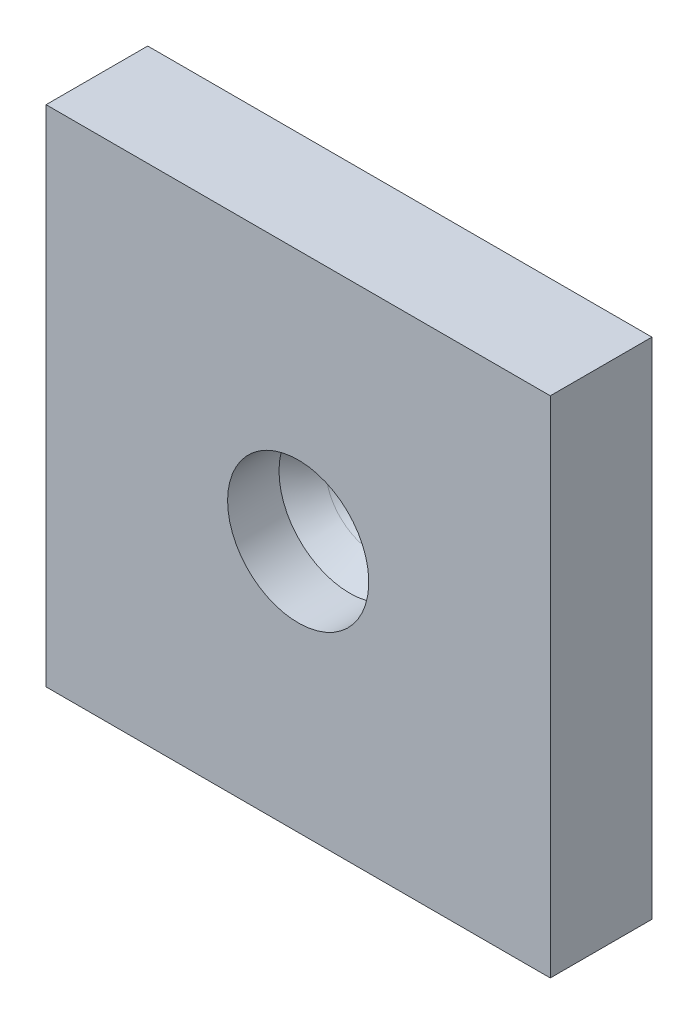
ISO-10303-21;
HEADER;
FILE_DESCRIPTION(('STEP AP214'),'2;1');
FILE_NAME('part.step','',(''),(''),'','','');
FILE_SCHEMA(('AUTOMOTIVE_DESIGN { 1 0 10303 214 1 1 1 1 }'));
ENDSEC;
DATA;
#1=APPLICATION_CONTEXT('core data for automotive mechanical design processes');
#2=APPLICATION_PROTOCOL_DEFINITION('international standard','automotive_design',2000,#1);
#3=PRODUCT_CONTEXT('',#1,'mechanical');
#4=PRODUCT('Part','Part','',(#3));
#5=PRODUCT_RELATED_PRODUCT_CATEGORY('part','',(#4));
#6=PRODUCT_DEFINITION_FORMATION('','',#4);
#7=PRODUCT_DEFINITION_CONTEXT('part definition',#1,'design');
#8=PRODUCT_DEFINITION('design','',#6,#7);
#9=PRODUCT_DEFINITION_SHAPE('','',#8);
#10=(LENGTH_UNIT() NAMED_UNIT(*) SI_UNIT(.MILLI.,.METRE.));
#11=(NAMED_UNIT(*) PLANE_ANGLE_UNIT() SI_UNIT($,.RADIAN.));
#12=(NAMED_UNIT(*) SI_UNIT($,.STERADIAN.) SOLID_ANGLE_UNIT());
#13=UNCERTAINTY_MEASURE_WITH_UNIT(LENGTH_MEASURE(1.E-05),#10,'distance_accuracy_value','');
#14=(GEOMETRIC_REPRESENTATION_CONTEXT(3) GLOBAL_UNCERTAINTY_ASSIGNED_CONTEXT((#13)) GLOBAL_UNIT_ASSIGNED_CONTEXT((#10,
#11,#12)) REPRESENTATION_CONTEXT('',''));
#15=CARTESIAN_POINT('',(0.,0.,0.));
#16=DIRECTION('',(0.,0.,1.));
#17=DIRECTION('',(1.,0.,0.));
#18=AXIS2_PLACEMENT_3D('',#15,#16,#17);
#19=CARTESIAN_POINT('',(0.,0.,0.));
#20=DIRECTION('',(0.,0.,1.));
#21=DIRECTION('',(0.,-1.,0.));
#22=AXIS2_PLACEMENT_3D('',#19,#20,#21);
#23=PLANE('',#22);
#24=DIRECTION('',(0.,1.,0.));
#25=VECTOR('',#24,1.);
#26=CARTESIAN_POINT('',(15.875,15.875,0.));
#27=LINE('',#26,#25);
#28=CARTESIAN_POINT('',(15.875,-15.875,0.));
#29=VERTEX_POINT('',#28);
#30=CARTESIAN_POINT('',(15.875,15.875,0.));
#31=VERTEX_POINT('',#30);
#32=EDGE_CURVE('E58',#29,#31,#27,.T.);
#33=ORIENTED_EDGE('',*,*,#32,.F.);
#34=DIRECTION('',(1.,0.,0.));
#35=VECTOR('',#34,1.);
#36=CARTESIAN_POINT('',(-15.875,-15.875,0.));
#37=LINE('',#36,#35);
#38=CARTESIAN_POINT('',(-15.875,-15.875,0.));
#39=VERTEX_POINT('',#38);
#40=EDGE_CURVE('E64',#39,#29,#37,.T.);
#41=ORIENTED_EDGE('',*,*,#40,.F.);
#42=DIRECTION('',(0.,-1.,0.));
#43=VECTOR('',#42,1.);
#44=CARTESIAN_POINT('',(-15.875,15.875,0.));
#45=LINE('',#44,#43);
#46=CARTESIAN_POINT('',(-15.875,15.875,0.));
#47=VERTEX_POINT('',#46);
#48=EDGE_CURVE('E95',#47,#39,#45,.T.);
#49=ORIENTED_EDGE('',*,*,#48,.F.);
#50=DIRECTION('',(-1.,0.,0.));
#51=VECTOR('',#50,1.);
#52=CARTESIAN_POINT('',(-15.875,15.875,0.));
#53=LINE('',#52,#51);
#54=EDGE_CURVE('E93',#31,#47,#53,.T.);
#55=ORIENTED_EDGE('',*,*,#54,.F.);
#56=EDGE_LOOP('',(#33,#41,#49,#55));
#57=FACE_BOUND('',#56,.T.);
#58=CARTESIAN_POINT('',(0.,0.,0.));
#59=DIRECTION('',(0.,0.,-1.));
#60=DIRECTION('',(0.,1.,0.));
#61=AXIS2_PLACEMENT_3D('',#58,#59,#60);
#62=CIRCLE('',#61,2.2479);
#63=CARTESIAN_POINT('',(0.,2.2479,0.));
#64=VERTEX_POINT('',#63);
#65=EDGE_CURVE('E85',#64,#64,#62,.T.);
#66=ORIENTED_EDGE('',*,*,#65,.F.);
#67=EDGE_LOOP('',(#66));
#68=FACE_BOUND('',#67,.T.);
#69=ADVANCED_FACE('F14',(#57,#68),#23,.F.);
#70=CARTESIAN_POINT('',(15.875,15.875,0.));
#71=DIRECTION('',(1.,0.,0.));
#72=DIRECTION('',(0.,1.,0.));
#73=AXIS2_PLACEMENT_3D('',#70,#71,#72);
#74=PLANE('',#73);
#75=DIRECTION('',(0.,0.,1.));
#76=VECTOR('',#75,1.);
#77=CARTESIAN_POINT('',(15.875,15.875,0.));
#78=LINE('',#77,#76);
#79=CARTESIAN_POINT('',(15.875,15.875,6.4));
#80=VERTEX_POINT('',#79);
#81=EDGE_CURVE('E54',#31,#80,#78,.T.);
#82=ORIENTED_EDGE('',*,*,#81,.T.);
#83=DIRECTION('',(0.,-1.,0.));
#84=VECTOR('',#83,1.);
#85=CARTESIAN_POINT('',(15.875,15.875,6.4));
#86=LINE('',#85,#84);
#87=CARTESIAN_POINT('',(15.875,-15.875,6.4));
#88=VERTEX_POINT('',#87);
#89=EDGE_CURVE('E57',#80,#88,#86,.T.);
#90=ORIENTED_EDGE('',*,*,#89,.T.);
#91=DIRECTION('',(0.,0.,1.));
#92=VECTOR('',#91,1.);
#93=CARTESIAN_POINT('',(15.875,-15.875,0.));
#94=LINE('',#93,#92);
#95=EDGE_CURVE('E9',#29,#88,#94,.T.);
#96=ORIENTED_EDGE('',*,*,#95,.F.);
#97=ORIENTED_EDGE('',*,*,#32,.T.);
#98=EDGE_LOOP('',(#82,#90,#96,#97));
#99=FACE_BOUND('',#98,.T.);
#100=ADVANCED_FACE('F56',(#99),#74,.T.);
#101=CARTESIAN_POINT('',(-15.875,-15.875,0.));
#102=DIRECTION('',(0.,-1.,0.));
#103=DIRECTION('',(1.,0.,0.));
#104=AXIS2_PLACEMENT_3D('',#101,#102,#103);
#105=PLANE('',#104);
#106=ORIENTED_EDGE('',*,*,#95,.T.);
#107=DIRECTION('',(-1.,0.,0.));
#108=VECTOR('',#107,1.);
#109=CARTESIAN_POINT('',(15.875,-15.875,6.4));
#110=LINE('',#109,#108);
#111=CARTESIAN_POINT('',(-15.875,-15.875,6.4));
#112=VERTEX_POINT('',#111);
#113=EDGE_CURVE('E73',#88,#112,#110,.T.);
#114=ORIENTED_EDGE('',*,*,#113,.T.);
#115=DIRECTION('',(0.,0.,1.));
#116=VECTOR('',#115,1.);
#117=CARTESIAN_POINT('',(-15.875,-15.875,0.));
#118=LINE('',#117,#116);
#119=EDGE_CURVE('E24',#39,#112,#118,.T.);
#120=ORIENTED_EDGE('',*,*,#119,.F.);
#121=ORIENTED_EDGE('',*,*,#40,.T.);
#122=EDGE_LOOP('',(#106,#114,#120,#121));
#123=FACE_BOUND('',#122,.T.);
#124=ADVANCED_FACE('F125',(#123),#105,.T.);
#125=CARTESIAN_POINT('',(-15.875,15.875,0.));
#126=DIRECTION('',(-1.,0.,0.));
#127=DIRECTION('',(0.,-1.,0.));
#128=AXIS2_PLACEMENT_3D('',#125,#126,#127);
#129=PLANE('',#128);
#130=ORIENTED_EDGE('',*,*,#119,.T.);
#131=DIRECTION('',(0.,1.,0.));
#132=VECTOR('',#131,1.);
#133=CARTESIAN_POINT('',(-15.875,-15.875,6.4));
#134=LINE('',#133,#132);
#135=CARTESIAN_POINT('',(-15.875,15.875,6.4));
#136=VERTEX_POINT('',#135);
#137=EDGE_CURVE('E82',#112,#136,#134,.T.);
#138=ORIENTED_EDGE('',*,*,#137,.T.);
#139=DIRECTION('',(0.,0.,1.));
#140=VECTOR('',#139,1.);
#141=CARTESIAN_POINT('',(-15.875,15.875,0.));
#142=LINE('',#141,#140);
#143=EDGE_CURVE('E63',#47,#136,#142,.T.);
#144=ORIENTED_EDGE('',*,*,#143,.F.);
#145=ORIENTED_EDGE('',*,*,#48,.T.);
#146=EDGE_LOOP('',(#130,#138,#144,#145));
#147=FACE_BOUND('',#146,.T.);
#148=ADVANCED_FACE('F128',(#147),#129,.T.);
#149=CARTESIAN_POINT('',(-15.875,15.875,0.));
#150=DIRECTION('',(0.,1.,0.));
#151=DIRECTION('',(-1.,0.,0.));
#152=AXIS2_PLACEMENT_3D('',#149,#150,#151);
#153=PLANE('',#152);
#154=ORIENTED_EDGE('',*,*,#143,.T.);
#155=DIRECTION('',(1.,0.,0.));
#156=VECTOR('',#155,1.);
#157=CARTESIAN_POINT('',(-15.875,15.875,6.4));
#158=LINE('',#157,#156);
#159=EDGE_CURVE('E71',#136,#80,#158,.T.);
#160=ORIENTED_EDGE('',*,*,#159,.T.);
#161=ORIENTED_EDGE('',*,*,#81,.F.);
#162=ORIENTED_EDGE('',*,*,#54,.T.);
#163=EDGE_LOOP('',(#154,#160,#161,#162));
#164=FACE_BOUND('',#163,.T.);
#165=ADVANCED_FACE('F75',(#164),#153,.T.);
#166=CARTESIAN_POINT('',(0.,0.,1.5875));
#167=DIRECTION('',(0.,0.,1.));
#168=DIRECTION('',(0.,-1.,0.));
#169=AXIS2_PLACEMENT_3D('',#166,#167,#168);
#170=CONICAL_SURFACE('',#169,3.07589561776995,0.715584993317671);
#171=CARTESIAN_POINT('',(0.,0.,0.635));
#172=DIRECTION('',(0.,0.,-1.));
#173=DIRECTION('',(0.,1.,0.));
#174=AXIS2_PLACEMENT_3D('',#171,#172,#173);
#175=CIRCLE('',#174,2.2479);
#176=CARTESIAN_POINT('',(0.,2.2479,0.635));
#177=VERTEX_POINT('',#176);
#178=EDGE_CURVE('E88',#177,#177,#175,.T.);
#179=ORIENTED_EDGE('',*,*,#178,.T.);
#180=EDGE_LOOP('',(#179));
#181=FACE_BOUND('',#180,.T.);
#182=CARTESIAN_POINT('',(0.,0.,1.5875));
#183=DIRECTION('',(0.,0.,-1.));
#184=DIRECTION('',(0.,-1.,0.));
#185=AXIS2_PLACEMENT_3D('',#182,#183,#184);
#186=CIRCLE('',#185,3.07594);
#187=CARTESIAN_POINT('',(0.,-3.07594,1.5875));
#188=VERTEX_POINT('',#187);
#189=EDGE_CURVE('E91',#188,#188,#186,.T.);
#190=ORIENTED_EDGE('',*,*,#189,.F.);
#191=EDGE_LOOP('',(#190));
#192=FACE_BOUND('',#191,.T.);
#193=ADVANCED_FACE('F108',(#181,#192),#170,.F.);
#194=CARTESIAN_POINT('',(0.,0.,1.5875));
#195=DIRECTION('',(0.,0.,-1.));
#196=DIRECTION('',(0.,1.,0.));
#197=AXIS2_PLACEMENT_3D('',#194,#195,#196);
#198=CYLINDRICAL_SURFACE('',#197,2.2479);
#199=ORIENTED_EDGE('',*,*,#65,.T.);
#200=EDGE_LOOP('',(#199));
#201=FACE_BOUND('',#200,.T.);
#202=ORIENTED_EDGE('',*,*,#178,.F.);
#203=EDGE_LOOP('',(#202));
#204=FACE_BOUND('',#203,.T.);
#205=ADVANCED_FACE('F118',(#201,#204),#198,.F.);
#206=CARTESIAN_POINT('',(0.,0.,6.35));
#207=DIRECTION('',(0.,0.,-1.));
#208=DIRECTION('',(0.,1.,0.));
#209=AXIS2_PLACEMENT_3D('',#206,#207,#208);
#210=CYLINDRICAL_SURFACE('',#209,4.445);
#211=CARTESIAN_POINT('',(0.,0.,3.16242337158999));
#212=DIRECTION('',(0.,0.,1.));
#213=DIRECTION('',(0.,-1.,0.));
#214=AXIS2_PLACEMENT_3D('',#211,#212,#213);
#215=CIRCLE('',#214,4.445);
#216=CARTESIAN_POINT('',(0.,-4.445,3.16242337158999));
#217=VERTEX_POINT('',#216);
#218=EDGE_CURVE('E84',#217,#217,#215,.T.);
#219=ORIENTED_EDGE('',*,*,#218,.F.);
#220=EDGE_LOOP('',(#219));
#221=FACE_BOUND('',#220,.T.);
#222=CARTESIAN_POINT('',(0.,0.,6.4));
#223=DIRECTION('',(0.,0.,-1.));
#224=DIRECTION('',(-1.,0.,0.));
#225=AXIS2_PLACEMENT_3D('',#222,#223,#224);
#226=CIRCLE('',#225,4.445);
#227=CARTESIAN_POINT('',(-4.445,0.,6.4));
#228=VERTEX_POINT('',#227);
#229=EDGE_CURVE('E76',#228,#228,#226,.T.);
#230=ORIENTED_EDGE('',*,*,#229,.F.);
#231=EDGE_LOOP('',(#230));
#232=FACE_BOUND('',#231,.T.);
#233=ADVANCED_FACE('F16',(#221,#232),#210,.F.);
#234=CARTESIAN_POINT('',(0.,0.,1.5875));
#235=DIRECTION('',(0.,0.,1.));
#236=DIRECTION('',(0.,-1.,0.));
#237=AXIS2_PLACEMENT_3D('',#234,#235,#236);
#238=CONICAL_SURFACE('',#237,3.07594,0.715584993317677);
#239=ORIENTED_EDGE('',*,*,#218,.T.);
#240=EDGE_LOOP('',(#239));
#241=FACE_BOUND('',#240,.T.);
#242=ORIENTED_EDGE('',*,*,#189,.T.);
#243=EDGE_LOOP('',(#242));
#244=FACE_BOUND('',#243,.T.);
#245=ADVANCED_FACE('F124',(#241,#244),#238,.F.);
#246=CARTESIAN_POINT('',(0.,0.,6.4));
#247=DIRECTION('',(0.,0.,-1.));
#248=DIRECTION('',(-1.,0.,0.));
#249=AXIS2_PLACEMENT_3D('',#246,#247,#248);
#250=PLANE('',#249);
#251=ORIENTED_EDGE('',*,*,#229,.T.);
#252=EDGE_LOOP('',(#251));
#253=FACE_BOUND('',#252,.T.);
#254=ORIENTED_EDGE('',*,*,#159,.F.);
#255=ORIENTED_EDGE('',*,*,#137,.F.);
#256=ORIENTED_EDGE('',*,*,#113,.F.);
#257=ORIENTED_EDGE('',*,*,#89,.F.);
#258=EDGE_LOOP('',(#254,#255,#256,#257));
#259=FACE_BOUND('',#258,.T.);
#260=ADVANCED_FACE('F69',(#253,#259),#250,.F.);
#261=CLOSED_SHELL('',(#69,#100,#124,#148,#165,#193,#205,#233,#245,#260));
#262=MANIFOLD_SOLID_BREP('B1',#261);
#263=ADVANCED_BREP_SHAPE_REPRESENTATION('',(#18,#262),#14);
#264=SHAPE_DEFINITION_REPRESENTATION(#9,#263);
ENDSEC;
END-ISO-10303-21;
